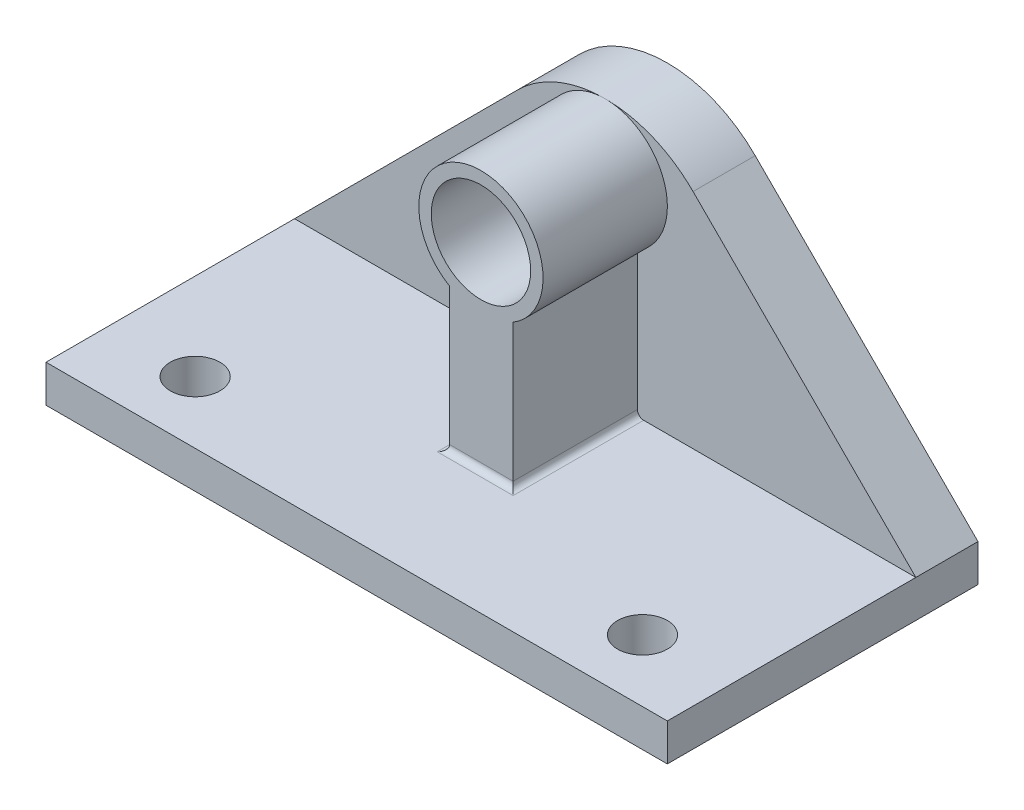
from build123d import *

# Parameters (mm, degrees)
IZIM1_W                     = 500
IZIM1_H                     = 200
Y_KSEKLIK_EKSTR_ZYON1_DEPTH = 30
Y_KSEKLIK_EKSTR_ZYON2_DEPTH = 50
Y_KSEKLIK_EKSTR_ZYON3_DEPTH = 100
IZIM4_R                     = 40
KES_EKSTR_ZYON2_DEPTH       = 210
RADYUS1_R                   = 5
RADYUS2_R                   = 5
IZIM5_R                     = 20
KES_EKSTR_ZYON3_DEPTH       = 210


with BuildPart() as part:
    # izim1 → Y_kseklik-Ekstr_zyon1 (new body)
    with BuildSketch(Plane(origin=(0, 0, 0), x_dir=(1, 0, 0), z_dir=(0, 1, 0))):
        Rectangle(IZIM1_W, IZIM1_H)
    extrude(amount=Y_KSEKLIK_EKSTR_ZYON1_DEPTH)

    # izim2 → Y_kseklik-Ekstr_zyon2 (add)
    with BuildSketch(Plane.XY.offset(-100)):
        with BuildLine():
            Line((250, 30), (250, 0))
            Line((250, 0), (-250, 0))
            Line((-250, 0), (-250, 30))
            Line((-250, 30), (-70.811195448, 209.188804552))
            ThreePointArc((-70.811195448, 209.188804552), (-0.071147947, 238.578689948), (70.710606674, 209.289393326))
            Line((70.710606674, 209.289393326), (250, 30))
        make_face()
    extrude(amount=-Y_KSEKLIK_EKSTR_ZYON2_DEPTH)

    # izim3 → Y_kseklik-Ekstr_zyon3 (add)
    with BuildSketch(Plane.XY.offset(-100)):
        with BuildLine():
            Line((-25.143722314, 30), (-25.143722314, 145.360716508))
            ThreePointArc((-25.143722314, 145.360716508), (-0.457667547, 238.576595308), (25.93065445, 145.828237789))
            Line((25.93065445, 145.828237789), (25.93065445, 30))
            Line((25.93065445, 30), (-25.143722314, 30))
        make_face()
    extrude(amount=Y_KSEKLIK_EKSTR_ZYON3_DEPTH)

    # izim4 → Kes-Ekstr_zyon2 (cut)
    with BuildSketch(Plane.XY):
        with Locations((0, 188.578689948)):
            Circle(IZIM4_R)
    extrude(amount=-KES_EKSTR_ZYON2_DEPTH, mode=Mode.SUBTRACT)

    # Radyus1
    radyus1_edges = [part.edges().sort_by_distance(p)[0] for p in [
        (25.93065445, 30, -50),
    ]]
    fillet(radyus1_edges, radius=RADYUS1_R)

    # Radyus2
    radyus2_edges = [part.edges().sort_by_distance(p)[0] for p in [
        (-25.143722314, 30, -50),
        (2.893466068, 30, 0),
    ]]
    fillet(radyus2_edges, radius=RADYUS2_R)

    # izim5 → Kes-Ekstr_zyon3 (cut)
    with BuildSketch(Plane(origin=(0, 30, 0), x_dir=(1, 0, 0), z_dir=(0, 1, 0))):
        with Locations(Location((-180, -50, 0), (0, 0, 270))):
            Circle(IZIM5_R)
        with Locations(Location((180, -50, 0), (0, 0, 270))):
            Circle(IZIM5_R)
    extrude(amount=-KES_EKSTR_ZYON3_DEPTH, mode=Mode.SUBTRACT)


solid = part.part
